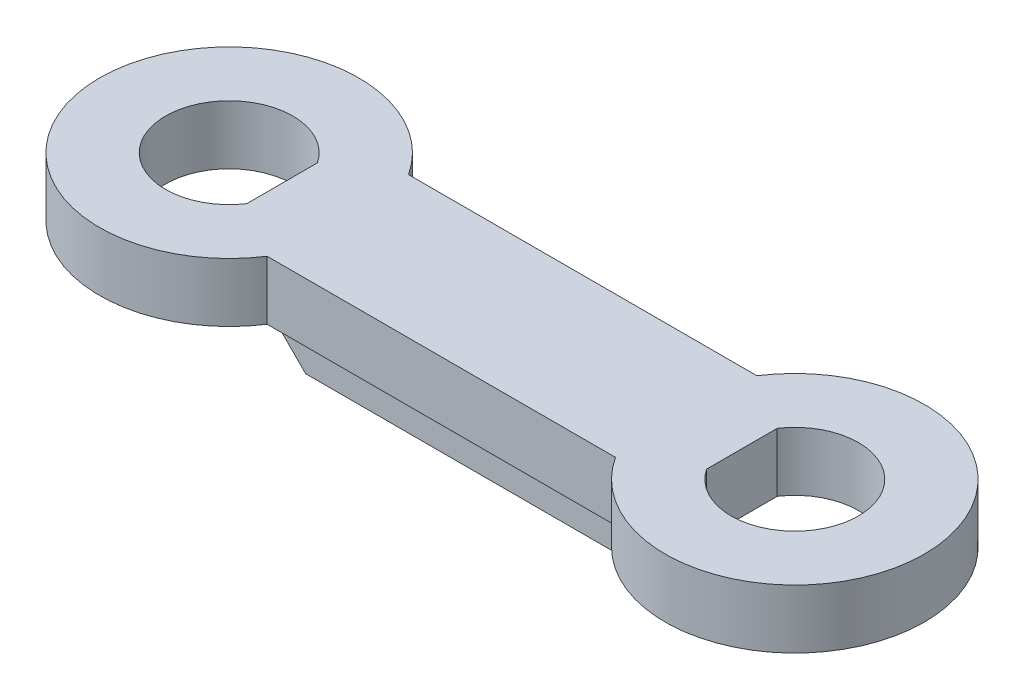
ISO-10303-21;
HEADER;
FILE_DESCRIPTION(('STEP AP214'),'2;1');
FILE_NAME('part.step','',(''),(''),'','','');
FILE_SCHEMA(('AUTOMOTIVE_DESIGN { 1 0 10303 214 1 1 1 1 }'));
ENDSEC;
DATA;
#1=APPLICATION_CONTEXT('core data for automotive mechanical design processes');
#2=APPLICATION_PROTOCOL_DEFINITION('international standard','automotive_design',2000,#1);
#3=PRODUCT_CONTEXT('',#1,'mechanical');
#4=PRODUCT('Part','Part','',(#3));
#5=PRODUCT_RELATED_PRODUCT_CATEGORY('part','',(#4));
#6=PRODUCT_DEFINITION_FORMATION('','',#4);
#7=PRODUCT_DEFINITION_CONTEXT('part definition',#1,'design');
#8=PRODUCT_DEFINITION('design','',#6,#7);
#9=PRODUCT_DEFINITION_SHAPE('','',#8);
#10=(LENGTH_UNIT() NAMED_UNIT(*) SI_UNIT(.MILLI.,.METRE.));
#11=(NAMED_UNIT(*) PLANE_ANGLE_UNIT() SI_UNIT($,.RADIAN.));
#12=(NAMED_UNIT(*) SI_UNIT($,.STERADIAN.) SOLID_ANGLE_UNIT());
#13=UNCERTAINTY_MEASURE_WITH_UNIT(LENGTH_MEASURE(1.E-05),#10,'distance_accuracy_value','');
#14=(GEOMETRIC_REPRESENTATION_CONTEXT(3) GLOBAL_UNCERTAINTY_ASSIGNED_CONTEXT((#13)) GLOBAL_UNIT_ASSIGNED_CONTEXT((#10,
#11,#12)) REPRESENTATION_CONTEXT('',''));
#15=CARTESIAN_POINT('',(0.,0.,0.));
#16=DIRECTION('',(0.,0.,1.));
#17=DIRECTION('',(1.,0.,0.));
#18=AXIS2_PLACEMENT_3D('',#15,#16,#17);
#19=CARTESIAN_POINT('',(1.509041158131,-14.1,61.863));
#20=DIRECTION('',(0.,1.,0.));
#21=DIRECTION('',(-1.,0.,0.));
#22=AXIS2_PLACEMENT_3D('',#19,#20,#21);
#23=PLANE('',#22);
#24=DIRECTION('',(0.,0.,-1.));
#25=VECTOR('',#24,1.);
#26=CARTESIAN_POINT('',(1.451001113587,-14.1,62.175));
#27=LINE('',#26,#25);
#28=CARTESIAN_POINT('',(1.451001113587,-14.1,62.475));
#29=VERTEX_POINT('',#28);
#30=CARTESIAN_POINT('',(1.451001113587,-14.1,61.875));
#31=VERTEX_POINT('',#30);
#32=EDGE_CURVE('E98',#29,#31,#27,.T.);
#33=ORIENTED_EDGE('',*,*,#32,.F.);
#34=DIRECTION('',(1.,0.,0.));
#35=VECTOR('',#34,1.);
#36=CARTESIAN_POINT('',(0.,-14.1,62.475));
#37=LINE('',#36,#35);
#38=CARTESIAN_POINT('',(-1.451001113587,-14.1,62.475));
#39=VERTEX_POINT('',#38);
#40=EDGE_CURVE('E93',#29,#39,#37,.F.);
#41=ORIENTED_EDGE('',*,*,#40,.T.);
#42=DIRECTION('',(0.,0.,1.));
#43=VECTOR('',#42,1.);
#44=CARTESIAN_POINT('',(-1.451001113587,-14.1,62.175));
#45=LINE('',#44,#43);
#46=CARTESIAN_POINT('',(-1.451001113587,-14.1,61.875));
#47=VERTEX_POINT('',#46);
#48=EDGE_CURVE('E100',#47,#39,#45,.T.);
#49=ORIENTED_EDGE('',*,*,#48,.F.);
#50=DIRECTION('',(-1.,0.,0.));
#51=VECTOR('',#50,1.);
#52=CARTESIAN_POINT('',(0.,-14.1,61.875));
#53=LINE('',#52,#51);
#54=EDGE_CURVE('E110',#47,#31,#53,.F.);
#55=ORIENTED_EDGE('',*,*,#54,.T.);
#56=EDGE_LOOP('',(#33,#41,#49,#55));
#57=FACE_BOUND('',#56,.T.);
#58=ADVANCED_FACE('F16',(#57),#23,.F.);
#59=CARTESIAN_POINT('',(-2.029041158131,-14.11,62.475));
#60=DIRECTION('',(0.,0.,1.));
#61=DIRECTION('',(1.,0.,0.));
#62=AXIS2_PLACEMENT_3D('',#59,#60,#61);
#63=PLANE('',#62);
#64=DIRECTION('',(-0.707106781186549,-0.707106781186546,0.));
#65=VECTOR('',#64,1.);
#66=CARTESIAN_POINT('',(1.701001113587,-13.85,62.475));
#67=LINE('',#66,#65);
#68=CARTESIAN_POINT('',(1.95100111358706,-13.6,62.4749999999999));
#69=VERTEX_POINT('',#68);
#70=EDGE_CURVE('E171',#29,#69,#67,.F.);
#71=ORIENTED_EDGE('',*,*,#70,.T.);
#72=DIRECTION('',(1.,0.,0.));
#73=VECTOR('',#72,1.);
#74=CARTESIAN_POINT('',(0.,-13.6,62.475));
#75=LINE('',#74,#73);
#76=CARTESIAN_POINT('',(-1.95100111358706,-13.6,62.4749999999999));
#77=VERTEX_POINT('',#76);
#78=EDGE_CURVE('E95',#69,#77,#75,.F.);
#79=ORIENTED_EDGE('',*,*,#78,.T.);
#80=DIRECTION('',(-0.707106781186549,0.707106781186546,0.));
#81=VECTOR('',#80,1.);
#82=CARTESIAN_POINT('',(-1.441001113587,-14.11,62.475));
#83=LINE('',#82,#81);
#84=EDGE_CURVE('E20',#39,#77,#83,.T.);
#85=ORIENTED_EDGE('',*,*,#84,.F.);
#86=ORIENTED_EDGE('',*,*,#40,.F.);
#87=EDGE_LOOP('',(#71,#79,#85,#86));
#88=FACE_BOUND('',#87,.T.);
#89=ADVANCED_FACE('F91',(#88),#63,.T.);
#90=CARTESIAN_POINT('',(2.029041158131,-14.11,61.875));
#91=DIRECTION('',(0.,0.,-1.));
#92=DIRECTION('',(-1.,0.,0.));
#93=AXIS2_PLACEMENT_3D('',#90,#91,#92);
#94=PLANE('',#93);
#95=DIRECTION('',(0.707106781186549,0.707106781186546,0.));
#96=VECTOR('',#95,1.);
#97=CARTESIAN_POINT('',(1.701001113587,-13.85,61.875));
#98=LINE('',#97,#96);
#99=CARTESIAN_POINT('',(1.95100111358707,-13.6,61.8750000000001));
#100=VERTEX_POINT('',#99);
#101=EDGE_CURVE('E163',#100,#31,#98,.F.);
#102=ORIENTED_EDGE('',*,*,#101,.T.);
#103=ORIENTED_EDGE('',*,*,#54,.F.);
#104=DIRECTION('',(-0.707106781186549,0.707106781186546,0.));
#105=VECTOR('',#104,1.);
#106=CARTESIAN_POINT('',(-1.441001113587,-14.11,61.875));
#107=LINE('',#106,#105);
#108=CARTESIAN_POINT('',(-1.95100111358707,-13.6,61.8750000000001));
#109=VERTEX_POINT('',#108);
#110=EDGE_CURVE('E102',#109,#47,#107,.F.);
#111=ORIENTED_EDGE('',*,*,#110,.F.);
#112=DIRECTION('',(-1.,0.,0.));
#113=VECTOR('',#112,1.);
#114=CARTESIAN_POINT('',(0.,-13.6,61.875));
#115=LINE('',#114,#113);
#116=EDGE_CURVE('E150',#109,#100,#115,.F.);
#117=ORIENTED_EDGE('',*,*,#116,.T.);
#118=EDGE_LOOP('',(#102,#103,#111,#117));
#119=FACE_BOUND('',#118,.T.);
#120=ADVANCED_FACE('F180',(#119),#94,.T.);
#121=CARTESIAN_POINT('',(1.441001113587,-14.11,61.863));
#122=DIRECTION('',(0.707106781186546,-0.707106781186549,0.));
#123=DIRECTION('',(0.707106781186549,0.707106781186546,0.));
#124=AXIS2_PLACEMENT_3D('',#121,#122,#123);
#125=PLANE('',#124);
#126=ORIENTED_EDGE('',*,*,#101,.F.);
#127=DIRECTION('',(0.,0.,-1.));
#128=VECTOR('',#127,1.);
#129=CARTESIAN_POINT('',(1.951001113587,-13.6,62.175));
#130=LINE('',#129,#128);
#131=EDGE_CURVE('E142',#100,#69,#130,.F.);
#132=ORIENTED_EDGE('',*,*,#131,.T.);
#133=ORIENTED_EDGE('',*,*,#70,.F.);
#134=ORIENTED_EDGE('',*,*,#32,.T.);
#135=EDGE_LOOP('',(#126,#132,#133,#134));
#136=FACE_BOUND('',#135,.T.);
#137=ADVANCED_FACE('F182',(#136),#125,.T.);
#138=CARTESIAN_POINT('',(-3.64130718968,-13.6,61.03025160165));
#139=DIRECTION('',(0.,-1.,0.));
#140=DIRECTION('',(1.,0.,0.));
#141=AXIS2_PLACEMENT_3D('',#138,#139,#140);
#142=PLANE('',#141);
#143=ORIENTED_EDGE('',*,*,#116,.F.);
#144=CARTESIAN_POINT('',(-2.4,-13.6,62.175));
#145=DIRECTION('',(0.,-1.,0.));
#146=DIRECTION('',(0.,0.,-1.));
#147=AXIS2_PLACEMENT_3D('',#144,#145,#146);
#148=CIRCLE('',#147,0.54);
#149=EDGE_CURVE('E134',#109,#77,#148,.F.);
#150=ORIENTED_EDGE('',*,*,#149,.T.);
#151=ORIENTED_EDGE('',*,*,#78,.F.);
#152=CARTESIAN_POINT('',(2.4,-13.6,62.175));
#153=DIRECTION('',(0.,-1.,0.));
#154=DIRECTION('',(0.,0.,-1.));
#155=AXIS2_PLACEMENT_3D('',#152,#153,#154);
#156=CIRCLE('',#155,0.54);
#157=EDGE_CURVE('E139',#69,#100,#156,.F.);
#158=ORIENTED_EDGE('',*,*,#157,.T.);
#159=EDGE_LOOP('',(#143,#150,#151,#158));
#160=FACE_BOUND('',#159,.T.);
#161=CARTESIAN_POINT('',(2.4,-13.6,62.175));
#162=DIRECTION('',(0.,-1.,0.));
#163=DIRECTION('',(0.,0.,-1.));
#164=AXIS2_PLACEMENT_3D('',#161,#162,#163);
#165=CIRCLE('',#164,1.1);
#166=CARTESIAN_POINT('',(1.47804555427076,-13.6,61.5749999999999));
#167=VERTEX_POINT('',#166);
#168=CARTESIAN_POINT('',(1.47804555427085,-13.6,62.775));
#169=VERTEX_POINT('',#168);
#170=EDGE_CURVE('E144',#167,#169,#165,.T.);
#171=ORIENTED_EDGE('',*,*,#170,.T.);
#172=DIRECTION('',(1.,0.,0.));
#173=VECTOR('',#172,1.);
#174=CARTESIAN_POINT('',(0.,-13.6,62.775));
#175=LINE('',#174,#173);
#176=CARTESIAN_POINT('',(-1.47804555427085,-13.6,62.775));
#177=VERTEX_POINT('',#176);
#178=EDGE_CURVE('E177',#169,#177,#175,.F.);
#179=ORIENTED_EDGE('',*,*,#178,.T.);
#180=CARTESIAN_POINT('',(-2.4,-13.6,62.175));
#181=DIRECTION('',(0.,-1.,0.));
#182=DIRECTION('',(0.,0.,-1.));
#183=AXIS2_PLACEMENT_3D('',#180,#181,#182);
#184=CIRCLE('',#183,1.1);
#185=CARTESIAN_POINT('',(-1.47804555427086,-13.6,61.575));
#186=VERTEX_POINT('',#185);
#187=EDGE_CURVE('E148',#177,#186,#184,.T.);
#188=ORIENTED_EDGE('',*,*,#187,.T.);
#189=DIRECTION('',(-1.,0.,0.));
#190=VECTOR('',#189,1.);
#191=CARTESIAN_POINT('',(0.,-13.6,61.575));
#192=LINE('',#191,#190);
#193=EDGE_CURVE('E155',#186,#167,#192,.F.);
#194=ORIENTED_EDGE('',*,*,#193,.T.);
#195=EDGE_LOOP('',(#171,#179,#188,#194));
#196=FACE_BOUND('',#195,.T.);
#197=ADVANCED_FACE('F225',(#160,#196),#142,.T.);
#198=CARTESIAN_POINT('',(-1.441001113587,-14.11,62.487));
#199=DIRECTION('',(-0.707106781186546,-0.707106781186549,0.));
#200=DIRECTION('',(-0.707106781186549,0.707106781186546,0.));
#201=AXIS2_PLACEMENT_3D('',#198,#199,#200);
#202=PLANE('',#201);
#203=ORIENTED_EDGE('',*,*,#84,.T.);
#204=DIRECTION('',(0.,0.,1.));
#205=VECTOR('',#204,1.);
#206=CARTESIAN_POINT('',(-1.951001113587,-13.6,62.175));
#207=LINE('',#206,#205);
#208=EDGE_CURVE('E137',#77,#109,#207,.F.);
#209=ORIENTED_EDGE('',*,*,#208,.T.);
#210=ORIENTED_EDGE('',*,*,#110,.T.);
#211=ORIENTED_EDGE('',*,*,#48,.T.);
#212=EDGE_LOOP('',(#203,#209,#210,#211));
#213=FACE_BOUND('',#212,.T.);
#214=ADVANCED_FACE('F101',(#213),#202,.T.);
#215=CARTESIAN_POINT('',(-2.4,-13.1,62.175));
#216=DIRECTION('',(0.,-1.,0.));
#217=DIRECTION('',(0.,0.,-1.));
#218=AXIS2_PLACEMENT_3D('',#215,#216,#217);
#219=CYLINDRICAL_SURFACE('',#218,1.1);
#220=ORIENTED_EDGE('',*,*,#187,.F.);
#221=DIRECTION('',(0.,-1.,0.));
#222=VECTOR('',#221,1.);
#223=CARTESIAN_POINT('',(-1.478045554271,-13.35,62.775));
#224=LINE('',#223,#222);
#225=CARTESIAN_POINT('',(-1.47804555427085,-13.1,62.775));
#226=VERTEX_POINT('',#225);
#227=EDGE_CURVE('E143',#177,#226,#224,.F.);
#228=ORIENTED_EDGE('',*,*,#227,.T.);
#229=CARTESIAN_POINT('',(-2.4,-13.1,62.175));
#230=DIRECTION('',(0.,-1.,0.));
#231=DIRECTION('',(0.,0.,-1.));
#232=AXIS2_PLACEMENT_3D('',#229,#230,#231);
#233=CIRCLE('',#232,1.1);
#234=CARTESIAN_POINT('',(-1.47804555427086,-13.1,61.575));
#235=VERTEX_POINT('',#234);
#236=EDGE_CURVE('E131',#226,#235,#233,.T.);
#237=ORIENTED_EDGE('',*,*,#236,.T.);
#238=DIRECTION('',(0.,1.,0.));
#239=VECTOR('',#238,1.);
#240=CARTESIAN_POINT('',(-1.478045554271,-13.35,61.575));
#241=LINE('',#240,#239);
#242=EDGE_CURVE('E149',#235,#186,#241,.F.);
#243=ORIENTED_EDGE('',*,*,#242,.T.);
#244=EDGE_LOOP('',(#220,#228,#237,#243));
#245=FACE_BOUND('',#244,.T.);
#246=ADVANCED_FACE('F245',(#245),#219,.T.);
#247=CARTESIAN_POINT('',(-1.537167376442,-13.09,61.575));
#248=DIRECTION('',(0.,0.,-1.));
#249=DIRECTION('',(1.,0.,0.));
#250=AXIS2_PLACEMENT_3D('',#247,#248,#249);
#251=PLANE('',#250);
#252=ORIENTED_EDGE('',*,*,#193,.F.);
#253=ORIENTED_EDGE('',*,*,#242,.F.);
#254=DIRECTION('',(1.,0.,0.));
#255=VECTOR('',#254,1.);
#256=CARTESIAN_POINT('',(0.,-13.1,61.575));
#257=LINE('',#256,#255);
#258=CARTESIAN_POINT('',(1.47804555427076,-13.1,61.5749999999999));
#259=VERTEX_POINT('',#258);
#260=EDGE_CURVE('E130',#235,#259,#257,.T.);
#261=ORIENTED_EDGE('',*,*,#260,.T.);
#262=DIRECTION('',(0.,-1.,0.));
#263=VECTOR('',#262,1.);
#264=CARTESIAN_POINT('',(1.4780455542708,-13.35,61.5749999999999));
#265=LINE('',#264,#263);
#266=EDGE_CURVE('E147',#259,#167,#265,.T.);
#267=ORIENTED_EDGE('',*,*,#266,.T.);
#268=EDGE_LOOP('',(#252,#253,#261,#267));
#269=FACE_BOUND('',#268,.T.);
#270=ADVANCED_FACE('F203',(#269),#251,.T.);
#271=CARTESIAN_POINT('',(2.4,-13.1,62.175));
#272=DIRECTION('',(0.,-1.,0.));
#273=DIRECTION('',(0.,0.,-1.));
#274=AXIS2_PLACEMENT_3D('',#271,#272,#273);
#275=CYLINDRICAL_SURFACE('',#274,1.1);
#276=ORIENTED_EDGE('',*,*,#170,.F.);
#277=ORIENTED_EDGE('',*,*,#266,.F.);
#278=CARTESIAN_POINT('',(2.4,-13.1,62.175));
#279=DIRECTION('',(0.,-1.,0.));
#280=DIRECTION('',(0.,0.,-1.));
#281=AXIS2_PLACEMENT_3D('',#278,#279,#280);
#282=CIRCLE('',#281,1.1);
#283=CARTESIAN_POINT('',(1.47804555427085,-13.1,62.775));
#284=VERTEX_POINT('',#283);
#285=EDGE_CURVE('E127',#259,#284,#282,.T.);
#286=ORIENTED_EDGE('',*,*,#285,.T.);
#287=DIRECTION('',(0.,1.,0.));
#288=VECTOR('',#287,1.);
#289=CARTESIAN_POINT('',(1.478045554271,-13.35,62.775));
#290=LINE('',#289,#288);
#291=EDGE_CURVE('E146',#284,#169,#290,.F.);
#292=ORIENTED_EDGE('',*,*,#291,.T.);
#293=EDGE_LOOP('',(#276,#277,#286,#292));
#294=FACE_BOUND('',#293,.T.);
#295=ADVANCED_FACE('F208',(#294),#275,.T.);
#296=CARTESIAN_POINT('',(1.537167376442,-13.09,62.775));
#297=DIRECTION('',(0.,0.,1.));
#298=DIRECTION('',(-1.,0.,0.));
#299=AXIS2_PLACEMENT_3D('',#296,#297,#298);
#300=PLANE('',#299);
#301=ORIENTED_EDGE('',*,*,#178,.F.);
#302=ORIENTED_EDGE('',*,*,#291,.F.);
#303=DIRECTION('',(-1.,0.,0.));
#304=VECTOR('',#303,1.);
#305=CARTESIAN_POINT('',(0.,-13.1,62.775));
#306=LINE('',#305,#304);
#307=EDGE_CURVE('E126',#284,#226,#306,.T.);
#308=ORIENTED_EDGE('',*,*,#307,.T.);
#309=ORIENTED_EDGE('',*,*,#227,.F.);
#310=EDGE_LOOP('',(#301,#302,#308,#309));
#311=FACE_BOUND('',#310,.T.);
#312=ADVANCED_FACE('F232',(#311),#300,.T.);
#313=CARTESIAN_POINT('',(2.4,-13.1,62.175));
#314=DIRECTION('',(0.,-1.,0.));
#315=DIRECTION('',(0.,0.,-1.));
#316=AXIS2_PLACEMENT_3D('',#313,#314,#315);
#317=CYLINDRICAL_SURFACE('',#316,0.54);
#318=DIRECTION('',(0.,-1.,0.));
#319=VECTOR('',#318,1.);
#320=CARTESIAN_POINT('',(1.951001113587,-13.35,62.475));
#321=LINE('',#320,#319);
#322=CARTESIAN_POINT('',(1.951001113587,-13.1,62.4749999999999));
#323=VERTEX_POINT('',#322);
#324=EDGE_CURVE('E169',#69,#323,#321,.F.);
#325=ORIENTED_EDGE('',*,*,#324,.T.);
#326=CARTESIAN_POINT('',(2.4,-13.1,62.175));
#327=DIRECTION('',(0.,-1.,0.));
#328=DIRECTION('',(0.,0.,-1.));
#329=AXIS2_PLACEMENT_3D('',#326,#327,#328);
#330=CIRCLE('',#329,0.54);
#331=CARTESIAN_POINT('',(1.951001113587,-13.1,61.8750000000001));
#332=VERTEX_POINT('',#331);
#333=EDGE_CURVE('E123',#323,#332,#330,.F.);
#334=ORIENTED_EDGE('',*,*,#333,.T.);
#335=DIRECTION('',(0.,1.,0.));
#336=VECTOR('',#335,1.);
#337=CARTESIAN_POINT('',(1.951001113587,-13.35,61.875));
#338=LINE('',#337,#336);
#339=EDGE_CURVE('E138',#332,#100,#338,.F.);
#340=ORIENTED_EDGE('',*,*,#339,.T.);
#341=ORIENTED_EDGE('',*,*,#157,.F.);
#342=EDGE_LOOP('',(#325,#334,#340,#341));
#343=FACE_BOUND('',#342,.T.);
#344=ADVANCED_FACE('F230',(#343),#317,.F.);
#345=CARTESIAN_POINT('',(1.951001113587,-13.61,62.487));
#346=DIRECTION('',(1.,0.,0.));
#347=DIRECTION('',(0.,0.,-1.));
#348=AXIS2_PLACEMENT_3D('',#345,#346,#347);
#349=PLANE('',#348);
#350=DIRECTION('',(0.,0.,1.));
#351=VECTOR('',#350,1.);
#352=CARTESIAN_POINT('',(1.951001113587,-13.1,62.175));
#353=LINE('',#352,#351);
#354=EDGE_CURVE('E122',#332,#323,#353,.T.);
#355=ORIENTED_EDGE('',*,*,#354,.T.);
#356=ORIENTED_EDGE('',*,*,#324,.F.);
#357=ORIENTED_EDGE('',*,*,#131,.F.);
#358=ORIENTED_EDGE('',*,*,#339,.F.);
#359=EDGE_LOOP('',(#355,#356,#357,#358));
#360=FACE_BOUND('',#359,.T.);
#361=ADVANCED_FACE('F187',(#360),#349,.T.);
#362=CARTESIAN_POINT('',(-2.4,-13.1,62.175));
#363=DIRECTION('',(0.,-1.,0.));
#364=DIRECTION('',(0.,0.,-1.));
#365=AXIS2_PLACEMENT_3D('',#362,#363,#364);
#366=CYLINDRICAL_SURFACE('',#365,0.54);
#367=DIRECTION('',(0.,1.,0.));
#368=VECTOR('',#367,1.);
#369=CARTESIAN_POINT('',(-1.951001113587,-13.35,62.475));
#370=LINE('',#369,#368);
#371=CARTESIAN_POINT('',(-1.951001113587,-13.1,62.4749999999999));
#372=VERTEX_POINT('',#371);
#373=EDGE_CURVE('E34',#372,#77,#370,.F.);
#374=ORIENTED_EDGE('',*,*,#373,.T.);
#375=ORIENTED_EDGE('',*,*,#149,.F.);
#376=DIRECTION('',(0.,-1.,0.));
#377=VECTOR('',#376,1.);
#378=CARTESIAN_POINT('',(-1.951001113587,-13.35,61.875));
#379=LINE('',#378,#377);
#380=CARTESIAN_POINT('',(-1.951001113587,-13.1,61.8750000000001));
#381=VERTEX_POINT('',#380);
#382=EDGE_CURVE('E218',#109,#381,#379,.F.);
#383=ORIENTED_EDGE('',*,*,#382,.T.);
#384=CARTESIAN_POINT('',(-2.4,-13.1,62.175));
#385=DIRECTION('',(0.,-1.,0.));
#386=DIRECTION('',(0.,0.,-1.));
#387=AXIS2_PLACEMENT_3D('',#384,#385,#386);
#388=CIRCLE('',#387,0.54);
#389=EDGE_CURVE('E26',#381,#372,#388,.F.);
#390=ORIENTED_EDGE('',*,*,#389,.T.);
#391=EDGE_LOOP('',(#374,#375,#383,#390));
#392=FACE_BOUND('',#391,.T.);
#393=ADVANCED_FACE('F226',(#392),#366,.F.);
#394=CARTESIAN_POINT('',(-1.951001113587,-13.61,61.863));
#395=DIRECTION('',(-1.,0.,0.));
#396=DIRECTION('',(0.,0.,1.));
#397=AXIS2_PLACEMENT_3D('',#394,#395,#396);
#398=PLANE('',#397);
#399=DIRECTION('',(0.,0.,-1.));
#400=VECTOR('',#399,1.);
#401=CARTESIAN_POINT('',(-1.951001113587,-13.1,62.175));
#402=LINE('',#401,#400);
#403=EDGE_CURVE('E11',#372,#381,#402,.T.);
#404=ORIENTED_EDGE('',*,*,#403,.T.);
#405=ORIENTED_EDGE('',*,*,#382,.F.);
#406=ORIENTED_EDGE('',*,*,#208,.F.);
#407=ORIENTED_EDGE('',*,*,#373,.F.);
#408=EDGE_LOOP('',(#404,#405,#406,#407));
#409=FACE_BOUND('',#408,.T.);
#410=ADVANCED_FACE('F223',(#409),#398,.T.);
#411=CARTESIAN_POINT('',(-3.64130718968,-13.1,61.03025160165));
#412=DIRECTION('',(0.,-1.,0.));
#413=DIRECTION('',(1.,0.,0.));
#414=AXIS2_PLACEMENT_3D('',#411,#412,#413);
#415=PLANE('',#414);
#416=ORIENTED_EDGE('',*,*,#389,.F.);
#417=ORIENTED_EDGE('',*,*,#403,.F.);
#418=EDGE_LOOP('',(#416,#417));
#419=FACE_BOUND('',#418,.T.);
#420=ORIENTED_EDGE('',*,*,#333,.F.);
#421=ORIENTED_EDGE('',*,*,#354,.F.);
#422=EDGE_LOOP('',(#420,#421));
#423=FACE_BOUND('',#422,.T.);
#424=ORIENTED_EDGE('',*,*,#285,.F.);
#425=ORIENTED_EDGE('',*,*,#260,.F.);
#426=ORIENTED_EDGE('',*,*,#236,.F.);
#427=ORIENTED_EDGE('',*,*,#307,.F.);
#428=EDGE_LOOP('',(#424,#425,#426,#427));
#429=FACE_BOUND('',#428,.T.);
#430=ADVANCED_FACE('F18',(#419,#423,#429),#415,.F.);
#431=CLOSED_SHELL('',(#58,#89,#120,#137,#197,#214,#246,#270,#295,#312,#344,#361,#393,#410,#430));
#432=MANIFOLD_SOLID_BREP('B1',#431);
#433=ADVANCED_BREP_SHAPE_REPRESENTATION('',(#18,#432),#14);
#434=SHAPE_DEFINITION_REPRESENTATION(#9,#433);
ENDSEC;
END-ISO-10303-21;
